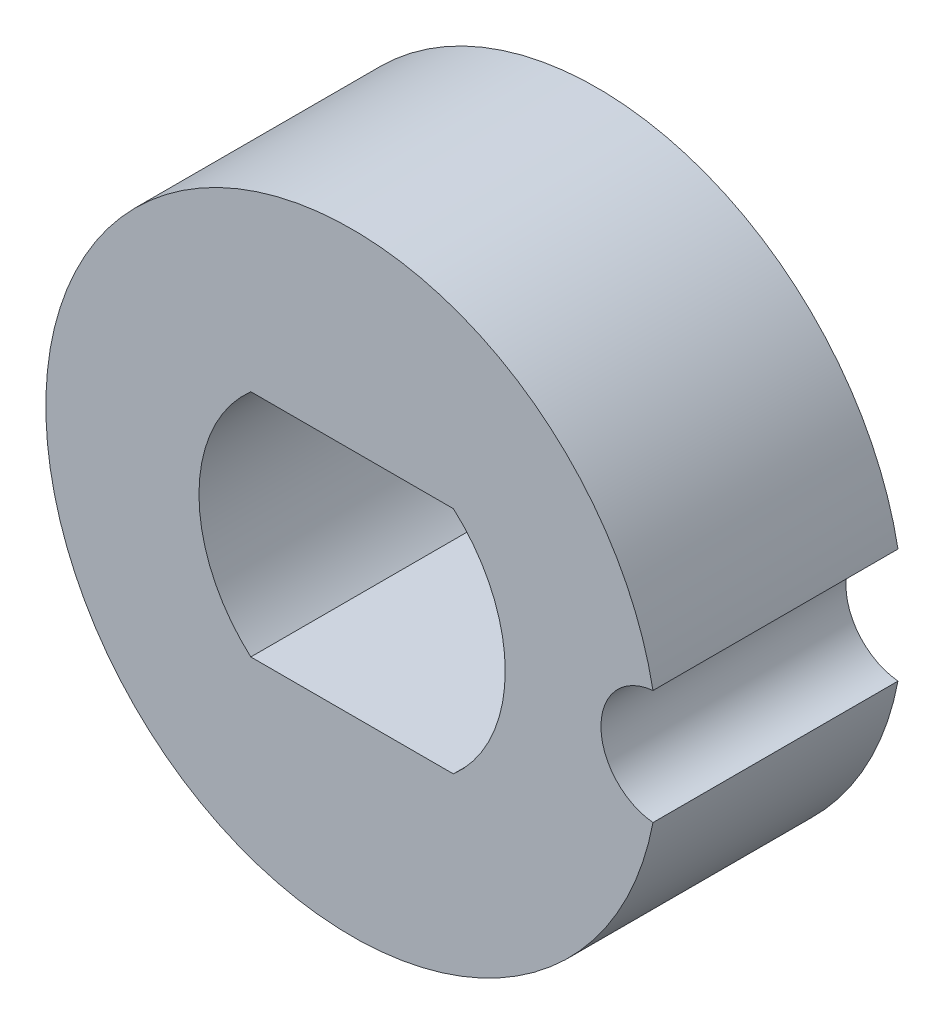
ISO-10303-21;
HEADER;
FILE_DESCRIPTION(('STEP AP214'),'2;1');
FILE_NAME('part.step','',(''),(''),'','','');
FILE_SCHEMA(('AUTOMOTIVE_DESIGN { 1 0 10303 214 1 1 1 1 }'));
ENDSEC;
DATA;
#1=APPLICATION_CONTEXT('core data for automotive mechanical design processes');
#2=APPLICATION_PROTOCOL_DEFINITION('international standard','automotive_design',2000,#1);
#3=PRODUCT_CONTEXT('',#1,'mechanical');
#4=PRODUCT('Part','Part','',(#3));
#5=PRODUCT_RELATED_PRODUCT_CATEGORY('part','',(#4));
#6=PRODUCT_DEFINITION_FORMATION('','',#4);
#7=PRODUCT_DEFINITION_CONTEXT('part definition',#1,'design');
#8=PRODUCT_DEFINITION('design','',#6,#7);
#9=PRODUCT_DEFINITION_SHAPE('','',#8);
#10=(LENGTH_UNIT() NAMED_UNIT(*) SI_UNIT(.MILLI.,.METRE.));
#11=(NAMED_UNIT(*) PLANE_ANGLE_UNIT() SI_UNIT($,.RADIAN.));
#12=(NAMED_UNIT(*) SI_UNIT($,.STERADIAN.) SOLID_ANGLE_UNIT());
#13=UNCERTAINTY_MEASURE_WITH_UNIT(LENGTH_MEASURE(1.E-05),#10,'distance_accuracy_value','');
#14=(GEOMETRIC_REPRESENTATION_CONTEXT(3) GLOBAL_UNCERTAINTY_ASSIGNED_CONTEXT((#13)) GLOBAL_UNIT_ASSIGNED_CONTEXT((#10,
#11,#12)) REPRESENTATION_CONTEXT('',''));
#15=CARTESIAN_POINT('',(0.,0.,0.));
#16=DIRECTION('',(0.,0.,1.));
#17=DIRECTION('',(1.,0.,0.));
#18=AXIS2_PLACEMENT_3D('',#15,#16,#17);
#19=CARTESIAN_POINT('',(6.35,0.,10.16));
#20=DIRECTION('',(0.,0.,1.));
#21=DIRECTION('',(1.,0.,0.));
#22=AXIS2_PLACEMENT_3D('',#19,#20,#21);
#23=PLANE('',#22);
#24=CARTESIAN_POINT('',(0.,0.,10.16));
#25=DIRECTION('',(0.,0.,1.));
#26=DIRECTION('',(1.,0.,0.));
#27=AXIS2_PLACEMENT_3D('',#24,#25,#26);
#28=CIRCLE('',#27,12.7);
#29=CARTESIAN_POINT('',(12.4767578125,2.37076242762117,10.16));
#30=VERTEX_POINT('',#29);
#31=CARTESIAN_POINT('',(12.4767578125,-2.37076242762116,10.16));
#32=VERTEX_POINT('',#31);
#33=EDGE_CURVE('E108',#30,#32,#28,.T.);
#34=ORIENTED_EDGE('',*,*,#33,.T.);
#35=CARTESIAN_POINT('',(12.7,0.,10.16));
#36=DIRECTION('',(0.,0.,1.));
#37=DIRECTION('',(1.,0.,0.));
#38=AXIS2_PLACEMENT_3D('',#35,#36,#37);
#39=CIRCLE('',#38,2.38125);
#40=EDGE_CURVE('E111',#30,#32,#39,.T.);
#41=ORIENTED_EDGE('',*,*,#40,.F.);
#42=EDGE_LOOP('',(#34,#41));
#43=FACE_BOUND('',#42,.T.);
#44=DIRECTION('',(-1.,0.,0.));
#45=VECTOR('',#44,1.);
#46=CARTESIAN_POINT('',(4.20013020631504,-4.7625,10.16));
#47=LINE('',#46,#45);
#48=CARTESIAN_POINT('',(4.20013020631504,-4.7625,10.16));
#49=VERTEX_POINT('',#48);
#50=CARTESIAN_POINT('',(-4.20013020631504,-4.7625,10.16));
#51=VERTEX_POINT('',#50);
#52=EDGE_CURVE('E92',#49,#51,#47,.T.);
#53=ORIENTED_EDGE('',*,*,#52,.T.);
#54=CARTESIAN_POINT('',(0.,0.,10.16));
#55=DIRECTION('',(0.,0.,1.));
#56=DIRECTION('',(1.,0.,0.));
#57=AXIS2_PLACEMENT_3D('',#54,#55,#56);
#58=CIRCLE('',#57,6.35);
#59=CARTESIAN_POINT('',(-4.20013020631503,4.7625,10.16));
#60=VERTEX_POINT('',#59);
#61=EDGE_CURVE('E68',#60,#51,#58,.T.);
#62=ORIENTED_EDGE('',*,*,#61,.F.);
#63=DIRECTION('',(-1.,0.,0.));
#64=VECTOR('',#63,1.);
#65=CARTESIAN_POINT('',(4.20013020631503,4.7625,10.16));
#66=LINE('',#65,#64);
#67=CARTESIAN_POINT('',(4.20013020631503,4.7625,10.16));
#68=VERTEX_POINT('',#67);
#69=EDGE_CURVE('E95',#68,#60,#66,.T.);
#70=ORIENTED_EDGE('',*,*,#69,.F.);
#71=CARTESIAN_POINT('',(0.,0.,10.16));
#72=DIRECTION('',(0.,0.,1.));
#73=DIRECTION('',(1.,0.,0.));
#74=AXIS2_PLACEMENT_3D('',#71,#72,#73);
#75=CIRCLE('',#74,6.35);
#76=EDGE_CURVE('E29',#49,#68,#75,.T.);
#77=ORIENTED_EDGE('',*,*,#76,.F.);
#78=EDGE_LOOP('',(#53,#62,#70,#77));
#79=FACE_BOUND('',#78,.T.);
#80=ADVANCED_FACE('F14',(#43,#79),#23,.T.);
#81=CARTESIAN_POINT('',(6.35,0.,0.));
#82=DIRECTION('',(0.,0.,1.));
#83=DIRECTION('',(1.,0.,0.));
#84=AXIS2_PLACEMENT_3D('',#81,#82,#83);
#85=PLANE('',#84);
#86=CARTESIAN_POINT('',(0.,0.,0.));
#87=DIRECTION('',(0.,0.,1.));
#88=DIRECTION('',(1.,0.,0.));
#89=AXIS2_PLACEMENT_3D('',#86,#87,#88);
#90=CIRCLE('',#89,12.7);
#91=CARTESIAN_POINT('',(12.4767578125,2.37076242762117,0.));
#92=VERTEX_POINT('',#91);
#93=CARTESIAN_POINT('',(12.4767578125,-2.37076242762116,0.));
#94=VERTEX_POINT('',#93);
#95=EDGE_CURVE('E72',#92,#94,#90,.T.);
#96=ORIENTED_EDGE('',*,*,#95,.F.);
#97=CARTESIAN_POINT('',(12.7,0.,0.));
#98=DIRECTION('',(0.,0.,1.));
#99=DIRECTION('',(1.,0.,0.));
#100=AXIS2_PLACEMENT_3D('',#97,#98,#99);
#101=CIRCLE('',#100,2.38125);
#102=EDGE_CURVE('E105',#92,#94,#101,.T.);
#103=ORIENTED_EDGE('',*,*,#102,.T.);
#104=EDGE_LOOP('',(#96,#103));
#105=FACE_BOUND('',#104,.T.);
#106=CARTESIAN_POINT('',(0.,0.,0.));
#107=DIRECTION('',(0.,0.,1.));
#108=DIRECTION('',(1.,0.,0.));
#109=AXIS2_PLACEMENT_3D('',#106,#107,#108);
#110=CIRCLE('',#109,6.35);
#111=CARTESIAN_POINT('',(-4.20013020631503,4.7625,0.));
#112=VERTEX_POINT('',#111);
#113=CARTESIAN_POINT('',(-4.20013020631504,-4.7625,0.));
#114=VERTEX_POINT('',#113);
#115=EDGE_CURVE('E37',#112,#114,#110,.T.);
#116=ORIENTED_EDGE('',*,*,#115,.T.);
#117=DIRECTION('',(-1.,0.,0.));
#118=VECTOR('',#117,1.);
#119=CARTESIAN_POINT('',(4.20013020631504,-4.7625,0.));
#120=LINE('',#119,#118);
#121=CARTESIAN_POINT('',(4.20013020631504,-4.7625,0.));
#122=VERTEX_POINT('',#121);
#123=EDGE_CURVE('E76',#122,#114,#120,.T.);
#124=ORIENTED_EDGE('',*,*,#123,.F.);
#125=CARTESIAN_POINT('',(0.,0.,0.));
#126=DIRECTION('',(0.,0.,1.));
#127=DIRECTION('',(1.,0.,0.));
#128=AXIS2_PLACEMENT_3D('',#125,#126,#127);
#129=CIRCLE('',#128,6.35);
#130=CARTESIAN_POINT('',(4.20013020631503,4.7625,0.));
#131=VERTEX_POINT('',#130);
#132=EDGE_CURVE('E81',#122,#131,#129,.T.);
#133=ORIENTED_EDGE('',*,*,#132,.T.);
#134=DIRECTION('',(-1.,0.,0.));
#135=VECTOR('',#134,1.);
#136=CARTESIAN_POINT('',(4.20013020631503,4.7625,0.));
#137=LINE('',#136,#135);
#138=EDGE_CURVE('E86',#131,#112,#137,.T.);
#139=ORIENTED_EDGE('',*,*,#138,.T.);
#140=EDGE_LOOP('',(#116,#124,#133,#139));
#141=FACE_BOUND('',#140,.T.);
#142=ADVANCED_FACE('F84',(#105,#141),#85,.F.);
#143=CARTESIAN_POINT('',(0.,0.,10.16));
#144=DIRECTION('',(0.,0.,-1.));
#145=DIRECTION('',(-1.,0.,0.));
#146=AXIS2_PLACEMENT_3D('',#143,#144,#145);
#147=CYLINDRICAL_SURFACE('',#146,12.7);
#148=DIRECTION('',(0.,0.,-1.));
#149=VECTOR('',#148,1.);
#150=CARTESIAN_POINT('',(12.4767578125,-2.37076242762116,10.16));
#151=LINE('',#150,#149);
#152=EDGE_CURVE('E9',#32,#94,#151,.T.);
#153=ORIENTED_EDGE('',*,*,#152,.F.);
#154=ORIENTED_EDGE('',*,*,#33,.F.);
#155=DIRECTION('',(0.,0.,-1.));
#156=VECTOR('',#155,1.);
#157=CARTESIAN_POINT('',(12.4767578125,2.37076242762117,10.16));
#158=LINE('',#157,#156);
#159=EDGE_CURVE('E22',#30,#92,#158,.T.);
#160=ORIENTED_EDGE('',*,*,#159,.T.);
#161=ORIENTED_EDGE('',*,*,#95,.T.);
#162=EDGE_LOOP('',(#153,#154,#160,#161));
#163=FACE_BOUND('',#162,.T.);
#164=ADVANCED_FACE('F116',(#163),#147,.T.);
#165=CARTESIAN_POINT('',(12.7,0.,10.16));
#166=DIRECTION('',(0.,0.,-1.));
#167=DIRECTION('',(-1.,0.,0.));
#168=AXIS2_PLACEMENT_3D('',#165,#166,#167);
#169=CYLINDRICAL_SURFACE('',#168,2.38125);
#170=ORIENTED_EDGE('',*,*,#40,.T.);
#171=ORIENTED_EDGE('',*,*,#152,.T.);
#172=ORIENTED_EDGE('',*,*,#102,.F.);
#173=ORIENTED_EDGE('',*,*,#159,.F.);
#174=EDGE_LOOP('',(#170,#171,#172,#173));
#175=FACE_BOUND('',#174,.T.);
#176=ADVANCED_FACE('F16',(#175),#169,.F.);
#177=CARTESIAN_POINT('',(0.,0.,10.16));
#178=DIRECTION('',(0.,0.,-1.));
#179=DIRECTION('',(-1.,0.,0.));
#180=AXIS2_PLACEMENT_3D('',#177,#178,#179);
#181=CYLINDRICAL_SURFACE('',#180,6.35);
#182=DIRECTION('',(0.,0.,-1.));
#183=VECTOR('',#182,1.);
#184=CARTESIAN_POINT('',(-4.20013020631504,-4.7625,10.16));
#185=LINE('',#184,#183);
#186=EDGE_CURVE('E64',#51,#114,#185,.T.);
#187=ORIENTED_EDGE('',*,*,#186,.T.);
#188=ORIENTED_EDGE('',*,*,#115,.F.);
#189=DIRECTION('',(0.,0.,-1.));
#190=VECTOR('',#189,1.);
#191=CARTESIAN_POINT('',(-4.20013020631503,4.7625,10.16));
#192=LINE('',#191,#190);
#193=EDGE_CURVE('E98',#60,#112,#192,.T.);
#194=ORIENTED_EDGE('',*,*,#193,.F.);
#195=ORIENTED_EDGE('',*,*,#61,.T.);
#196=EDGE_LOOP('',(#187,#188,#194,#195));
#197=FACE_BOUND('',#196,.T.);
#198=ADVANCED_FACE('F66',(#197),#181,.F.);
#199=CARTESIAN_POINT('',(4.20013020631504,-4.7625,10.16));
#200=DIRECTION('',(0.,-1.,0.));
#201=DIRECTION('',(1.,0.,0.));
#202=AXIS2_PLACEMENT_3D('',#199,#200,#201);
#203=PLANE('',#202);
#204=DIRECTION('',(0.,0.,-1.));
#205=VECTOR('',#204,1.);
#206=CARTESIAN_POINT('',(4.20013020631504,-4.7625,10.16));
#207=LINE('',#206,#205);
#208=EDGE_CURVE('E73',#49,#122,#207,.T.);
#209=ORIENTED_EDGE('',*,*,#208,.T.);
#210=ORIENTED_EDGE('',*,*,#123,.T.);
#211=ORIENTED_EDGE('',*,*,#186,.F.);
#212=ORIENTED_EDGE('',*,*,#52,.F.);
#213=EDGE_LOOP('',(#209,#210,#211,#212));
#214=FACE_BOUND('',#213,.T.);
#215=ADVANCED_FACE('F77',(#214),#203,.F.);
#216=CARTESIAN_POINT('',(0.,0.,10.16));
#217=DIRECTION('',(0.,0.,-1.));
#218=DIRECTION('',(-1.,0.,0.));
#219=AXIS2_PLACEMENT_3D('',#216,#217,#218);
#220=CYLINDRICAL_SURFACE('',#219,6.35);
#221=DIRECTION('',(0.,0.,-1.));
#222=VECTOR('',#221,1.);
#223=CARTESIAN_POINT('',(4.20013020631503,4.7625,10.16));
#224=LINE('',#223,#222);
#225=EDGE_CURVE('E100',#68,#131,#224,.T.);
#226=ORIENTED_EDGE('',*,*,#225,.T.);
#227=ORIENTED_EDGE('',*,*,#132,.F.);
#228=ORIENTED_EDGE('',*,*,#208,.F.);
#229=ORIENTED_EDGE('',*,*,#76,.T.);
#230=EDGE_LOOP('',(#226,#227,#228,#229));
#231=FACE_BOUND('',#230,.T.);
#232=ADVANCED_FACE('F128',(#231),#220,.F.);
#233=CARTESIAN_POINT('',(4.20013020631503,4.7625,10.16));
#234=DIRECTION('',(0.,-1.,0.));
#235=DIRECTION('',(1.,0.,0.));
#236=AXIS2_PLACEMENT_3D('',#233,#234,#235);
#237=PLANE('',#236);
#238=ORIENTED_EDGE('',*,*,#69,.T.);
#239=ORIENTED_EDGE('',*,*,#193,.T.);
#240=ORIENTED_EDGE('',*,*,#138,.F.);
#241=ORIENTED_EDGE('',*,*,#225,.F.);
#242=EDGE_LOOP('',(#238,#239,#240,#241));
#243=FACE_BOUND('',#242,.T.);
#244=ADVANCED_FACE('F127',(#243),#237,.T.);
#245=CLOSED_SHELL('',(#80,#142,#164,#176,#198,#215,#232,#244));
#246=MANIFOLD_SOLID_BREP('B1',#245);
#247=ADVANCED_BREP_SHAPE_REPRESENTATION('',(#18,#246),#14);
#248=SHAPE_DEFINITION_REPRESENTATION(#9,#247);
ENDSEC;
END-ISO-10303-21;
